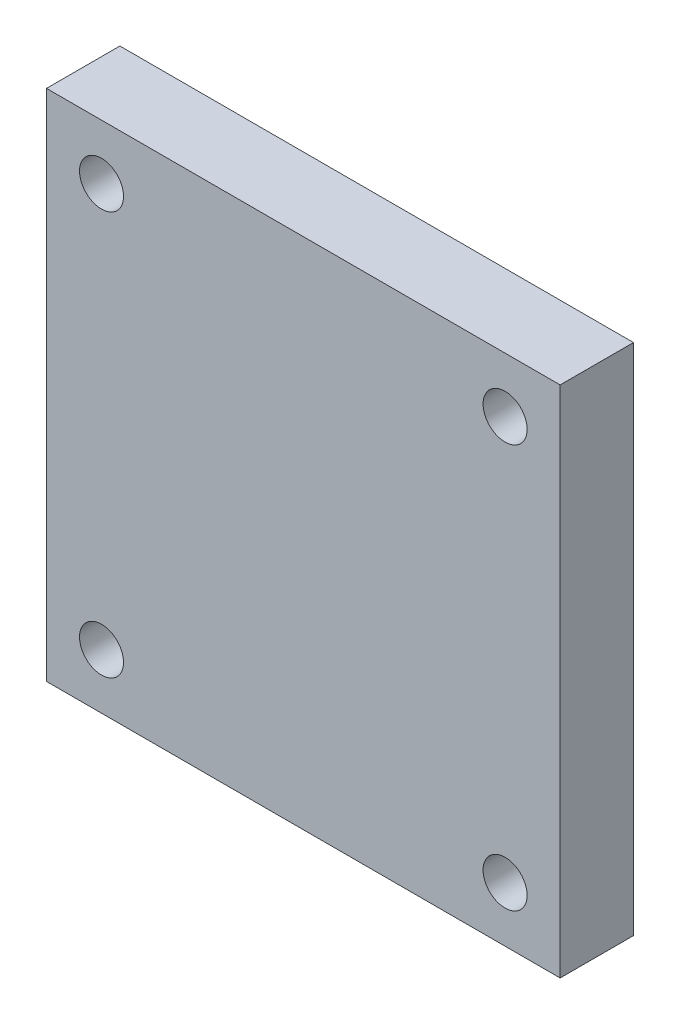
from build123d import *

# Parameters (mm, degrees)
ESQUISSE1_W        = 140
ESQUISSE1_H        = 140
ESQUISSE1_R        = 6
BOSS_EXTRU_1_DEPTH = 20


with BuildPart() as part:
    # Esquisse1 → Boss.-Extru.1 (new body)
    with BuildSketch(Plane.XY):
        Rectangle(ESQUISSE1_W, ESQUISSE1_H)
        with Locations((-55, 55)):
            Circle(ESQUISSE1_R, mode=Mode.SUBTRACT)
        with Locations((-55, -55)):
            Circle(ESQUISSE1_R, mode=Mode.SUBTRACT)
        with Locations(Location((55, -55, 0), (0, 0, 180))):
            Circle(ESQUISSE1_R, mode=Mode.SUBTRACT)
        with Locations(Location((55, 55, 0), (0, 0, 180))):
            Circle(ESQUISSE1_R, mode=Mode.SUBTRACT)
    extrude(amount=BOSS_EXTRU_1_DEPTH)


solid = part.part
